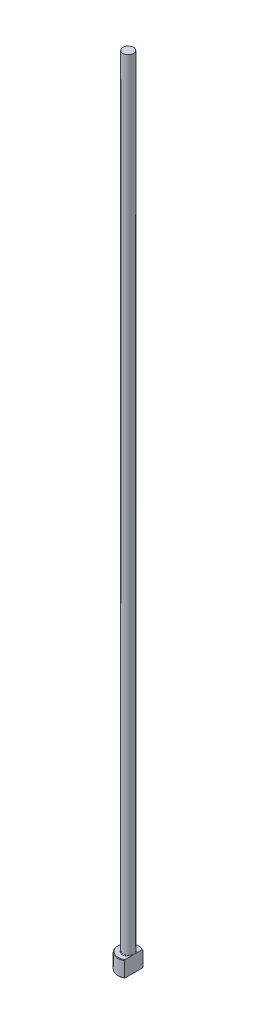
from build123d import *
from build123d.topology import SkipClean

# Parameters (mm, degrees)
CHAMFER1_SIZE    = 0.2
FILLET1_R        = 0.2
KEYED_HEAD_DEPTH = 301.053328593


with BuildPart() as part:
    # Sketch1 → Revolve1 (revolve)
    with BuildSketch(Plane.XY, mode=Mode.PRIVATE) as revolve1_sk:
        Polygon((0, 0), (-4, 0), (-4, 6), (-2, 6), (-2, 300), (0, 300), align=None)
    revolve(revolve1_sk.sketch.rotate(Axis((0, 259.958771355, 0), (0, -1, 0)), 270), axis=Axis((0, 259.958771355, 0), (0, -1, 0)))

    # Chamfer1
    chamfer1_edges = [part.edges().sort_by_distance(p)[0] for p in [
        (0, 6, -4),
        (0, 0, -4),
    ]]
    chamfer(chamfer1_edges, length=CHAMFER1_SIZE)

    # Fillet1
    fillet1_edges = [part.edges().sort_by_distance(p)[0] for p in [
        (0, 6, -2),
    ]]
    fillet(fillet1_edges, radius=FILLET1_R)

    # Sketch2 → KEYED HEAD (cut, through all)
    with SkipClean():  # the faces are left unmerged after this step: merging them gives an invalid solid
        with BuildSketch(Plane(origin=(0, 0, 0), x_dir=(1, 0, 0), z_dir=(0, 1, 0))):
            with BuildLine():
                Line((2, -3.464101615), (2, 3.464101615))
                ThreePointArc((2, 3.464101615), (4, 0), (2, -3.464101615))
            make_face()
        extrude(amount=KEYED_HEAD_DEPTH, mode=Mode.SUBTRACT)


solid = part.part
